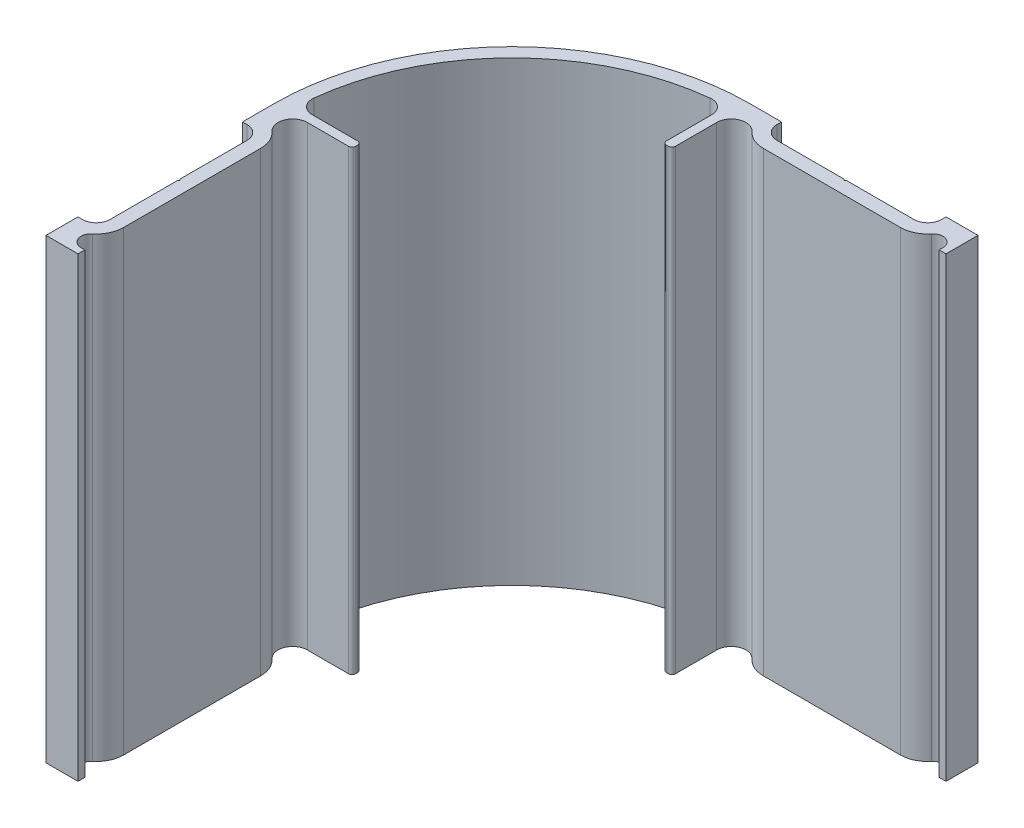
from build123d import *

# Parameters (mm, degrees)
EXTRUDE1_DEPTH = 50


with BuildPart() as part:
    # Sketch1 → Extrude1 (new, symmetric)
    with BuildSketch(Plane(origin=(0, 0, 0), x_dir=(1, 0, 0), z_dir=(0, 1, 0))):
        with BuildLine():
            Line((98.660644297, 102.003112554), (105.660644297, 102.003112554))
            Line((105.660644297, 102.003112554), (105.660644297, 95.003112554))
            Line((105.660644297, 95.003112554), (104.160644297, 95.003112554))
            Line((104.160644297, 95.003112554), (104.160644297, 95.830491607))
            ThreePointArc((104.160644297, 95.830491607), (102.718010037, 97.876805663), (100.305944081, 97.205588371))
            ThreePointArc((100.305944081, 97.205588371), (98.231135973, 95.581620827), (95.660644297, 95.003112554))
            Line((95.660644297, 95.003112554), (80.660644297, 95.003112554))
            Line((80.660644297, 95.003112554), (65.660644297, 95.003112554))
            ThreePointArc((65.660644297, 95.003112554), (63.234863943, 95.515345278), (61.223271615, 96.964582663))
            ThreePointArc((61.223271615, 96.964582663), (57.704437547, 97.794493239), (55.660644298, 94.812236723))
            Line((55.660644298, 94.812236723), (55.660644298, 85.803112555))
            ThreePointArc((55.660644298, 85.803112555), (55.426329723, 85.23742713), (54.860644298, 85.003112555))
            Line((54.860644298, 85.003112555), (54.460644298, 85.003112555))
            ThreePointArc((54.460644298, 85.003112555), (53.894958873, 85.23742713), (53.660644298, 85.803112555))
            Line((53.660644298, 85.803112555), (53.660644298, 95.730566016))
            ThreePointArc((53.660644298, 95.730566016), (52.663359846, 97.964202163), (50.334557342, 98.712791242))
            ThreePointArc((50.334557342, 98.712791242), (34.472968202, 94.185488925), (21.01241202, 84.651344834))
            ThreePointArc((21.01241202, 84.651344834), (11.478267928, 71.190788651), (6.950965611, 55.329199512))
            ThreePointArc((6.950965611, 55.329199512), (7.699554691, 53.000397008), (9.933190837, 52.003112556))
            Line((9.933190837, 52.003112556), (19.860644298, 52.003112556))
            ThreePointArc((19.860644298, 52.003112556), (20.426329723, 51.768797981), (20.660644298, 51.203112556))
            Line((20.660644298, 51.203112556), (20.660644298, 50.803112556))
            ThreePointArc((20.660644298, 50.803112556), (20.426329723, 50.237427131), (19.860644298, 50.003112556))
            Line((19.860644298, 50.003112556), (10.85152013, 50.003112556))
            ThreePointArc((10.85152013, 50.003112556), (7.869263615, 47.959319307), (8.699174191, 44.440485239))
            ThreePointArc((8.699174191, 44.440485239), (10.148411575, 42.428892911), (10.6606443, 40.003112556))
            Line((10.6606443, 40.003112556), (10.6606443, 25.003112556))
            Line((10.6606443, 25.003112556), (10.6606443, 10.003112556))
            ThreePointArc((10.6606443, 10.003112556), (10.082136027, 7.432620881), (8.458168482, 5.357812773))
            ThreePointArc((8.458168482, 5.357812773), (7.78695119, 2.945746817), (9.833265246, 1.503112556))
            Line((9.833265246, 1.503112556), (10.6606443, 1.503112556))
            Line((10.6606443, 1.503112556), (10.6606443, 0.003112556))
            Line((10.6606443, 0.003112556), (3.6606443, 0.003112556))
            Line((3.6606443, 0.003112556), (3.6606443, 7.003112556))
            Line((3.6606443, 7.003112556), (4.6606443, 7.003112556))
            ThreePointArc((4.6606443, 7.003112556), (6.781964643, 7.881792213), (7.6606443, 10.003112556))
            Line((7.6606443, 10.003112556), (7.6606443, 24.703112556))
            Line((7.6606443, 24.703112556), (7.960644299, 25.003112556))
            Line((7.960644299, 25.003112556), (7.660644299, 25.303112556))
            Line((7.660644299, 25.303112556), (7.660644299, 40.003112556))
            ThreePointArc((7.660644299, 40.003112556), (6.781964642, 42.1244329), (4.660644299, 43.003112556))
            Line((4.660644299, 43.003112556), (3.660644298, 43.003112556))
            Line((3.660644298, 43.003112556), (3.660644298, 50.003112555))
            ThreePointArc((3.660644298, 50.003112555), (7.618908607, 69.902651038), (18.891091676, 86.772665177))
            ThreePointArc((18.891091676, 86.772665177), (35.761105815, 98.044848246), (55.660644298, 102.003112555))
            Line((55.660644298, 102.003112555), (62.660644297, 102.003112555))
            Line((62.660644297, 102.003112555), (62.660644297, 101.003112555))
            ThreePointArc((62.660644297, 101.003112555), (63.539323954, 98.881792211), (65.660644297, 98.003112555))
            Line((65.660644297, 98.003112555), (80.360644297, 98.003112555))
            Line((80.360644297, 98.003112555), (80.660644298, 97.703112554))
            Line((80.660644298, 97.703112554), (80.960644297, 98.003112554))
            Line((80.960644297, 98.003112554), (95.660644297, 98.003112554))
            ThreePointArc((95.660644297, 98.003112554), (97.781964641, 98.88179221), (98.660644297, 101.003112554))
            Line((98.660644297, 101.003112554), (98.660644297, 102.003112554))
        make_face()
    extrude(amount=EXTRUDE1_DEPTH, both=True)


solid = part.part
